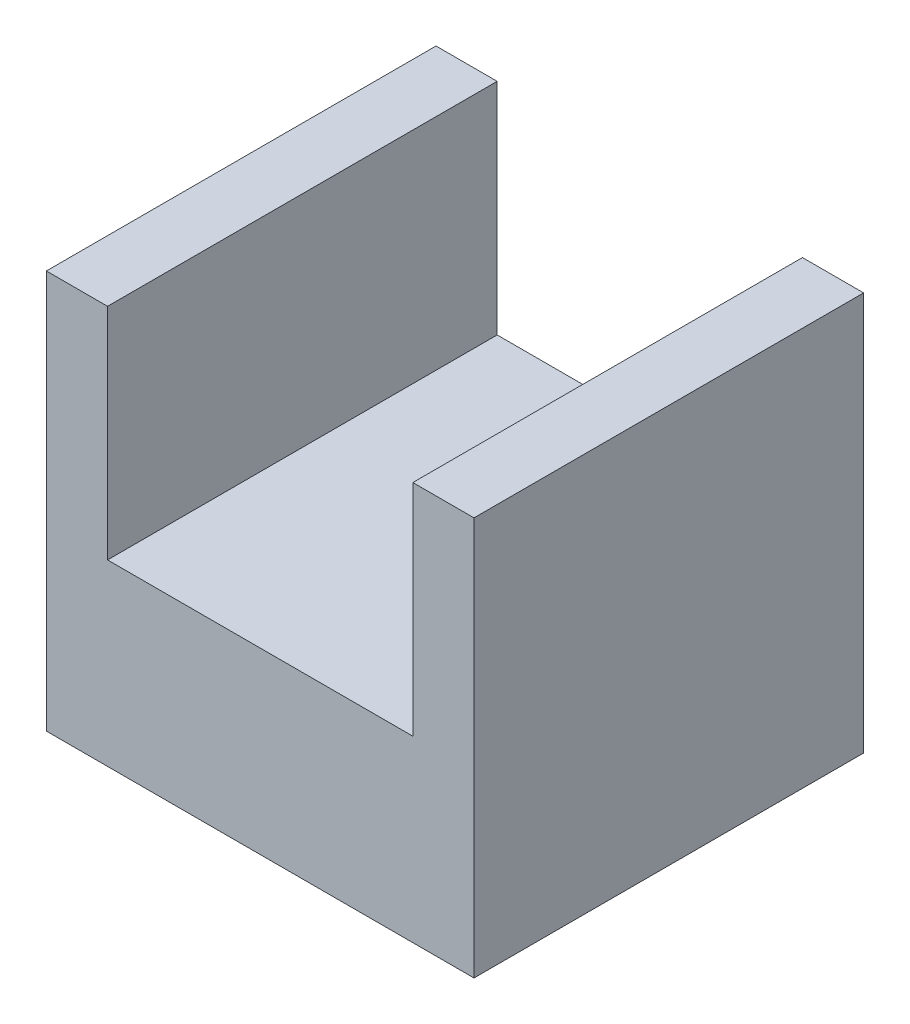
from build123d import *

# Parameters (mm, degrees)
SKETCH1_W           = 43.9
SKETCH1_H           = 40.91
BOSS_EXTRUDE1_DEPTH = 20
CUT_EXTRUDE1_REACH  = 52.002
SKETCH2_W           = 31.34
SKETCH2_H           = 22.55


with BuildPart() as part:
    # Sketch1 → Boss-Extrude1 (new, symmetric)
    with BuildSketch(Plane.XY):
        Rectangle(SKETCH1_W, SKETCH1_H)
    extrude(amount=BOSS_EXTRUDE1_DEPTH, both=True)

    # Sketch2 → Cut-Extrude1 (cut, up to next)
    with BuildSketch(Plane.XY.offset(20), mode=Mode.PRIVATE) as cut_extrude1_sk1:
        with Locations((0, 9.18)):
            Rectangle(SKETCH2_W, SKETCH2_H)
    cut_extrude1_tool1 = extrude(cut_extrude1_sk1.sketch, amount=-CUT_EXTRUDE1_REACH, mode=Mode.PRIVATE) & part.part
    add(cut_extrude1_tool1.solids().sort_by_distance((0, 9.18, 20))[0], mode=Mode.SUBTRACT)


solid = part.part
